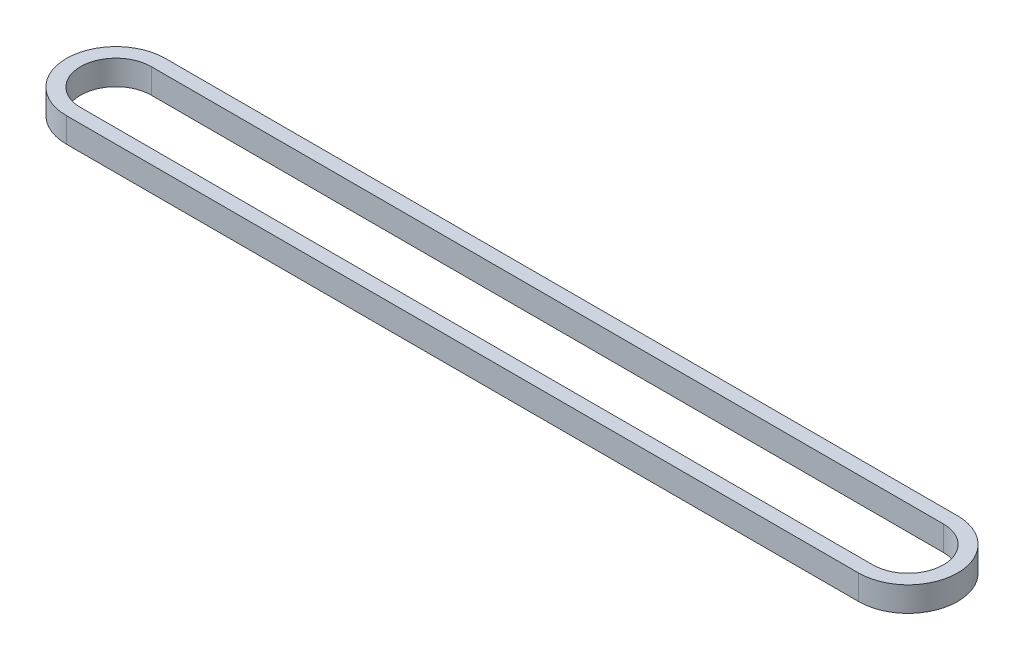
from build123d import *

# Parameters (mm, degrees)
BOSS_EXTRUDE1_DEPTH = 3.5


with BuildPart() as part:
    # Sketch1 → Boss-Extrude1 (new body)
    with BuildSketch(Plane(origin=(0, 0, 0), x_dir=(1, 0, 0), z_dir=(0, 1, 0))):
        with BuildLine():
            Line((0, -7), (-112, -7))
            ThreePointArc((-112, -7), (-119, 0), (-112, 7))
            Line((-112, 7), (0, 7))
            ThreePointArc((0, 7), (7, 0), (0, -7))
        make_face()
        with BuildLine():
            Line((0, -5), (-112, -5))
            ThreePointArc((-112, -5), (-117, 0), (-112, 5))
            Line((-112, 5), (0, 5))
            ThreePointArc((0, 5), (5, 0), (0, -5))
        make_face(mode=Mode.SUBTRACT)
    extrude(amount=BOSS_EXTRUDE1_DEPTH)


solid = part.part
